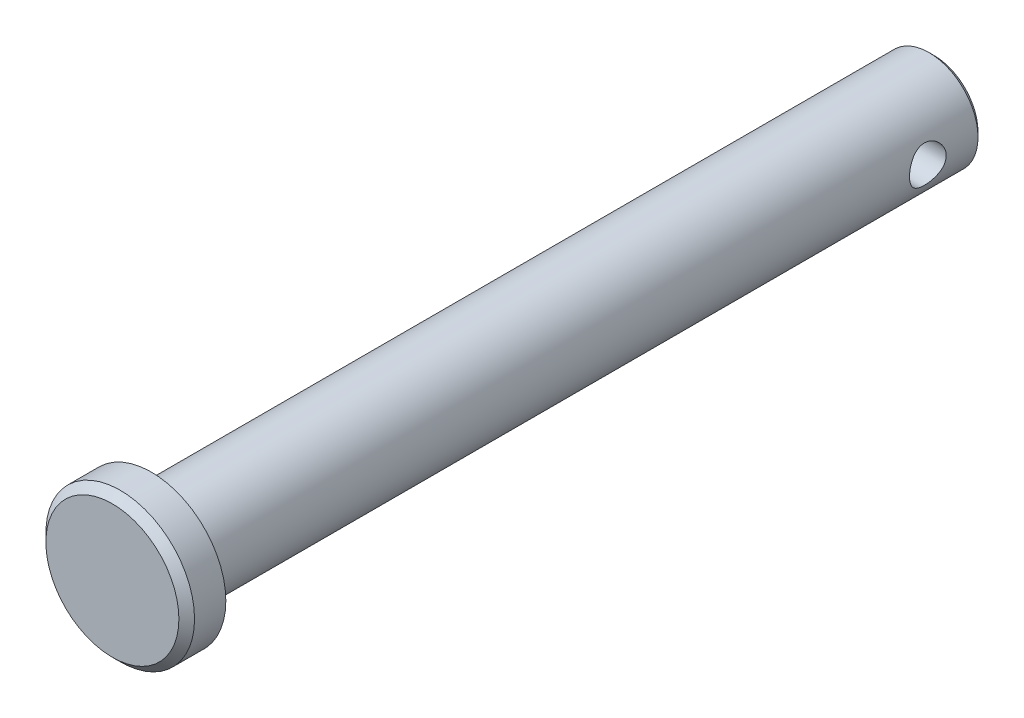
from build123d import *

# Parameters (mm, degrees)
SKETCH1_R           = 3.175
EXTRUDE1_DEPTH      = 25.4
SKETCH2_R           = 4.826
EXTRUDE2_DEPTH      = 2.54
CHAMFER1_SIZE       = 0.508
EXTRUDE3_DEPTH      = 29.761504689
EXTRUDE3_DEPTH_BACK = 29.761504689
SKETCH3_R           = 1.190625
CHAMFER2_SIZE       = 0.3175


with BuildPart() as part:
    # Sketch1 → Extrude1 (new, symmetric)
    with BuildSketch(Plane.XY):
        Circle(SKETCH1_R)
    extrude(amount=EXTRUDE1_DEPTH, both=True)

    # Sketch2 → Extrude2 (add)
    with BuildSketch(Plane.XY.offset(25.4)):
        Circle(SKETCH2_R)
    extrude(amount=EXTRUDE2_DEPTH)

    # Chamfer1
    chamfer1_edges = [part.edges().sort_by_distance(p)[0] for p in [
        (-4.826, 0, 27.94),
    ]]
    chamfer(chamfer1_edges, length=CHAMFER1_SIZE)

    # Sketch3 → Extrude3 (cut, two sides: drawn at the far end of the back side and taken through both)
    with BuildSketch(Plane(origin=(0, 0, 0), x_dir=(0, 0, -1), z_dir=(1, 0, 0)).offset(-EXTRUDE3_DEPTH_BACK)):
        with Locations(Location((21.828125, 0, 0), (0, 0, 179.999999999))):
            Circle(SKETCH3_R)
    extrude(amount=EXTRUDE3_DEPTH + EXTRUDE3_DEPTH_BACK, mode=Mode.SUBTRACT)

    # Chamfer2
    chamfer2_edges = [part.edges().sort_by_distance(p)[0] for p in [
        (-3.175, 0, -25.4),
    ]]
    chamfer(chamfer2_edges, length=CHAMFER2_SIZE)


solid = part.part
